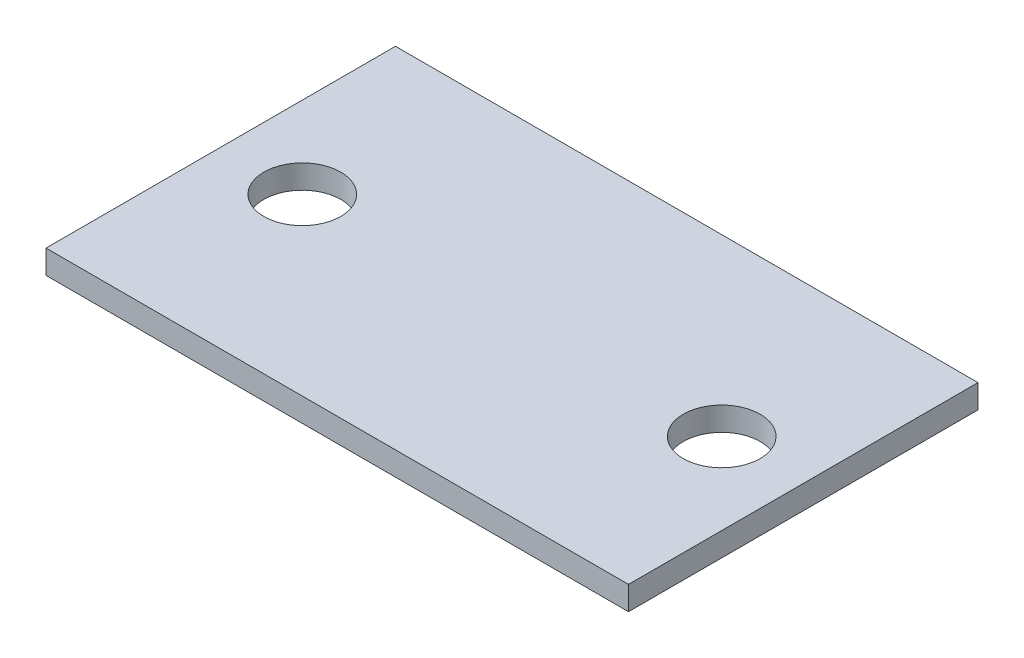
from build123d import *

# Parameters (mm, degrees)
SKETCH1_W           = 50
SKETCH1_H           = 30
BOSS_EXTRUDE1_DEPTH = 2.032
SKETCH2_R           = 3.3
CUT_EXTRUDE1_DEPTH  = 30.225485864


with BuildPart() as part:
    # Sketch1 → Boss-Extrude1 (new body)
    with BuildSketch(Plane(origin=(0, 0, 0), x_dir=(1, 0, 0), z_dir=(0, 1, 0))):
        Rectangle(SKETCH1_W, SKETCH1_H)
    extrude(amount=BOSS_EXTRUDE1_DEPTH)

    # Sketch2 → Cut-Extrude1 (cut, through all)
    with BuildSketch(Plane(origin=(0, 2.032, 0), x_dir=(1, 0, 0), z_dir=(0, 1, 0))):
        with Locations(Location((18, 0, 0), (0, 0, 270))):
            Circle(SKETCH2_R)
        with Locations(Location((-18, 0, 0), (0, 0, 90))):
            Circle(SKETCH2_R)
    extrude(amount=-CUT_EXTRUDE1_DEPTH, mode=Mode.SUBTRACT)


solid = part.part
